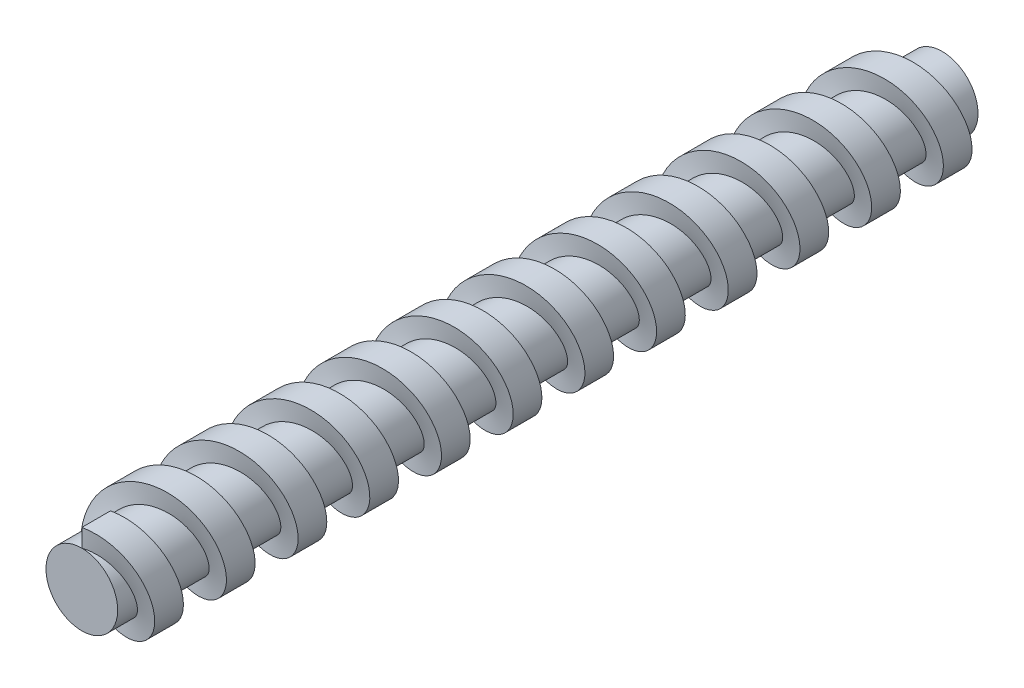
from build123d import *

# Parameters (mm, degrees)
ESQUISSE1_R           = 2.5
EXTRUSION1_DEPTH      = 60
BALAYAGE1_PITCH       = 5
BALAYAGE1_HEIGHT      = 58.75
BALAYAGE1_RADIUS      = 2.5
BALAYAGE1_START_ANGLE = 90
ESQUISSE2_W           = 2
ESQUISSE2_H           = 2.5


with BuildPart() as part:
    # Esquisse1 → Extrusion1 (new body)
    with BuildSketch(Plane.XY):
        Circle(ESQUISSE1_R)
    extrude(amount=EXTRUSION1_DEPTH)

    # Balayage1: sweep along a helix
    with BuildLine() as balayage1_path:
        add(Helix(BALAYAGE1_PITCH, BALAYAGE1_HEIGHT, BALAYAGE1_RADIUS, center=(0, 0, 60), direction=(0, 0, -1), mode=Mode.PRIVATE).rotate(Axis((0, 0, 60), (0, 0, -1)), BALAYAGE1_START_ANGLE))
    # Esquisse2 → Balayage1 (sweep)
    with BuildSketch(Plane(origin=(0, 0, 0), x_dir=(0, 0, -1), z_dir=(1, 0, 0))):
        with Locations((-59, 2.5)):
            Rectangle(ESQUISSE2_W, ESQUISSE2_H)
    sweep(path=balayage1_path.line, is_frenet=True)


solid = part.part
